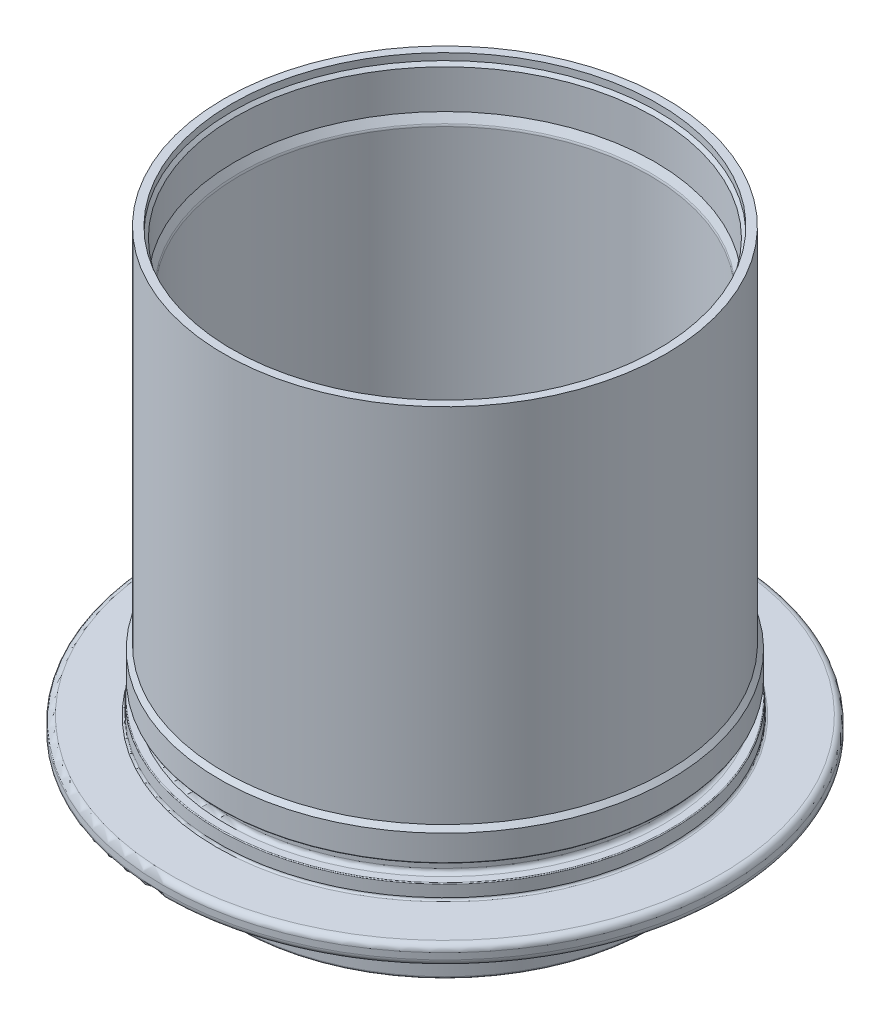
ISO-10303-21;
HEADER;
FILE_DESCRIPTION(('STEP AP214'),'2;1');
FILE_NAME('part.step','',(''),(''),'','','');
FILE_SCHEMA(('AUTOMOTIVE_DESIGN { 1 0 10303 214 1 1 1 1 }'));
ENDSEC;
DATA;
#1=APPLICATION_CONTEXT('core data for automotive mechanical design processes');
#2=APPLICATION_PROTOCOL_DEFINITION('international standard','automotive_design',2000,#1);
#3=PRODUCT_CONTEXT('',#1,'mechanical');
#4=PRODUCT('Part','Part','',(#3));
#5=PRODUCT_RELATED_PRODUCT_CATEGORY('part','',(#4));
#6=PRODUCT_DEFINITION_FORMATION('','',#4);
#7=PRODUCT_DEFINITION_CONTEXT('part definition',#1,'design');
#8=PRODUCT_DEFINITION('design','',#6,#7);
#9=PRODUCT_DEFINITION_SHAPE('','',#8);
#10=(LENGTH_UNIT() NAMED_UNIT(*) SI_UNIT(.MILLI.,.METRE.));
#11=(NAMED_UNIT(*) PLANE_ANGLE_UNIT() SI_UNIT($,.RADIAN.));
#12=(NAMED_UNIT(*) SI_UNIT($,.STERADIAN.) SOLID_ANGLE_UNIT());
#13=UNCERTAINTY_MEASURE_WITH_UNIT(LENGTH_MEASURE(1.E-05),#10,'distance_accuracy_value','');
#14=(GEOMETRIC_REPRESENTATION_CONTEXT(3) GLOBAL_UNCERTAINTY_ASSIGNED_CONTEXT((#13)) GLOBAL_UNIT_ASSIGNED_CONTEXT((#10,
#11,#12)) REPRESENTATION_CONTEXT('',''));
#15=CARTESIAN_POINT('',(0.,0.,0.));
#16=DIRECTION('',(0.,0.,1.));
#17=DIRECTION('',(1.,0.,0.));
#18=AXIS2_PLACEMENT_3D('',#15,#16,#17);
#19=CARTESIAN_POINT('',(-71.1716849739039,148.965678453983,0.));
#20=DIRECTION('',(0.,1.,0.));
#21=DIRECTION('',(-1.,0.,0.));
#22=AXIS2_PLACEMENT_3D('',#19,#20,#21);
#23=CONICAL_SURFACE('',#22,50.25,0.785398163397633);
#24=CARTESIAN_POINT('',(-71.1716849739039,148.965678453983,0.));
#25=DIRECTION('',(0.,1.,0.));
#26=DIRECTION('',(-1.,0.,0.));
#27=AXIS2_PLACEMENT_3D('',#24,#25,#26);
#28=CIRCLE('',#27,50.25);
#29=CARTESIAN_POINT('',(-121.421684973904,148.965678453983,0.));
#30=VERTEX_POINT('',#29);
#31=EDGE_CURVE('E78',#30,#30,#28,.T.);
#32=ORIENTED_EDGE('',*,*,#31,.F.);
#33=EDGE_LOOP('',(#32));
#34=FACE_BOUND('',#33,.T.);
#35=CARTESIAN_POINT('',(-71.1716849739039,149.715678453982,0.));
#36=DIRECTION('',(0.,1.,0.));
#37=DIRECTION('',(-1.,0.,0.));
#38=AXIS2_PLACEMENT_3D('',#35,#36,#37);
#39=CIRCLE('',#38,51.);
#40=CARTESIAN_POINT('',(-122.171684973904,149.715678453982,0.));
#41=VERTEX_POINT('',#40);
#42=EDGE_CURVE('E53',#41,#41,#39,.T.);
#43=ORIENTED_EDGE('',*,*,#42,.T.);
#44=EDGE_LOOP('',(#43));
#45=FACE_BOUND('',#44,.T.);
#46=ADVANCED_FACE('F34',(#34,#45),#23,.F.);
#47=CARTESIAN_POINT('',(-71.1716849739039,54.6294667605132,0.));
#48=DIRECTION('',(0.,1.,0.));
#49=DIRECTION('',(-1.,0.,0.));
#50=AXIS2_PLACEMENT_3D('',#47,#48,#49);
#51=TOROIDAL_SURFACE('',#50,37.0850000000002,11.9999999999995);
#52=CARTESIAN_POINT('',(-71.1716849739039,54.6294667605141,0.));
#53=DIRECTION('',(0.,1.,0.));
#54=DIRECTION('',(-1.,0.,0.));
#55=AXIS2_PLACEMENT_3D('',#52,#53,#54);
#56=CIRCLE('',#55,49.085);
#57=CARTESIAN_POINT('',(-120.256684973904,54.629466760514,0.));
#58=VERTEX_POINT('',#57);
#59=EDGE_CURVE('E55',#58,#58,#56,.T.);
#60=ORIENTED_EDGE('',*,*,#59,.T.);
#61=EDGE_LOOP('',(#60));
#62=FACE_BOUND('',#61,.T.);
#63=CARTESIAN_POINT('',(-71.1716849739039,46.1441853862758,0.));
#64=DIRECTION('',(0.,1.,0.));
#65=DIRECTION('',(-1.,0.,0.));
#66=AXIS2_PLACEMENT_3D('',#63,#64,#65);
#67=CIRCLE('',#66,45.5702813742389);
#68=CARTESIAN_POINT('',(-116.741966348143,46.1441853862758,0.));
#69=VERTEX_POINT('',#68);
#70=EDGE_CURVE('E41',#69,#69,#67,.T.);
#71=ORIENTED_EDGE('',*,*,#70,.F.);
#72=EDGE_LOOP('',(#71));
#73=FACE_BOUND('',#72,.T.);
#74=ADVANCED_FACE('F36',(#62,#73),#51,.F.);
#75=CARTESIAN_POINT('',(-71.1716849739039,40.4667972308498,0.));
#76=DIRECTION('',(0.,1.,0.));
#77=DIRECTION('',(-1.,0.,0.));
#78=AXIS2_PLACEMENT_3D('',#75,#76,#77);
#79=CONICAL_SURFACE('',#78,39.8928932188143,0.785398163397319);
#80=ORIENTED_EDGE('',*,*,#70,.T.);
#81=EDGE_LOOP('',(#80));
#82=FACE_BOUND('',#81,.T.);
#83=CARTESIAN_POINT('',(-71.1716849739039,40.4667972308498,0.));
#84=DIRECTION('',(0.,1.,0.));
#85=DIRECTION('',(-1.,0.,0.));
#86=AXIS2_PLACEMENT_3D('',#83,#84,#85);
#87=CIRCLE('',#86,39.8928932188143);
#88=CARTESIAN_POINT('',(-111.064578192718,40.4667972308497,0.));
#89=VERTEX_POINT('',#88);
#90=EDGE_CURVE('E45',#89,#89,#87,.T.);
#91=ORIENTED_EDGE('',*,*,#90,.F.);
#92=EDGE_LOOP('',(#91));
#93=FACE_BOUND('',#92,.T.);
#94=ADVANCED_FACE('F196',(#82,#93),#79,.F.);
#95=CARTESIAN_POINT('',(-71.1716849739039,39.7596904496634,0.));
#96=DIRECTION('',(0.,1.,0.));
#97=DIRECTION('',(-1.,0.,0.));
#98=AXIS2_PLACEMENT_3D('',#95,#96,#97);
#99=TOROIDAL_SURFACE('',#98,40.6000000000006,1.00000000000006);
#100=ORIENTED_EDGE('',*,*,#90,.T.);
#101=EDGE_LOOP('',(#100));
#102=FACE_BOUND('',#101,.T.);
#103=CARTESIAN_POINT('',(-71.1716849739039,39.7596904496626,0.));
#104=DIRECTION('',(0.,1.,0.));
#105=DIRECTION('',(-1.,0.,0.));
#106=AXIS2_PLACEMENT_3D('',#103,#104,#105);
#107=CIRCLE('',#106,39.6000000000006);
#108=CARTESIAN_POINT('',(-110.771684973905,39.7596904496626,0.));
#109=VERTEX_POINT('',#108);
#110=EDGE_CURVE('E50',#109,#109,#107,.T.);
#111=ORIENTED_EDGE('',*,*,#110,.F.);
#112=EDGE_LOOP('',(#111));
#113=FACE_BOUND('',#112,.T.);
#114=ADVANCED_FACE('F194',(#102,#113),#99,.T.);
#115=CARTESIAN_POINT('',(-71.1716849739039,158.736724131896,0.));
#116=DIRECTION('',(0.,1.,0.));
#117=DIRECTION('',(-1.,0.,0.));
#118=AXIS2_PLACEMENT_3D('',#115,#116,#117);
#119=CYLINDRICAL_SURFACE('',#118,39.6000000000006);
#120=ORIENTED_EDGE('',*,*,#110,.T.);
#121=EDGE_LOOP('',(#120));
#122=FACE_BOUND('',#121,.T.);
#123=CARTESIAN_POINT('',(-71.1716849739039,39.2739577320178,0.));
#124=DIRECTION('',(0.,1.,0.));
#125=DIRECTION('',(-1.,0.,0.));
#126=AXIS2_PLACEMENT_3D('',#123,#124,#125);
#127=CIRCLE('',#126,39.6000000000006);
#128=CARTESIAN_POINT('',(-110.771684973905,39.2739577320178,0.));
#129=VERTEX_POINT('',#128);
#130=EDGE_CURVE('E186',#129,#129,#127,.T.);
#131=ORIENTED_EDGE('',*,*,#130,.F.);
#132=EDGE_LOOP('',(#131));
#133=FACE_BOUND('',#132,.T.);
#134=ADVANCED_FACE('F191',(#122,#133),#119,.F.);
#135=CARTESIAN_POINT('',(-71.1716849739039,39.2739577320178,0.));
#136=DIRECTION('',(0.,1.,0.));
#137=DIRECTION('',(-1.,0.,0.));
#138=AXIS2_PLACEMENT_3D('',#135,#136,#137);
#139=TOROIDAL_SURFACE('',#138,40.0000000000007,0.400000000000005);
#140=ORIENTED_EDGE('',*,*,#130,.T.);
#141=EDGE_LOOP('',(#140));
#142=FACE_BOUND('',#141,.T.);
#143=CARTESIAN_POINT('',(-71.1716849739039,38.8739577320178,0.));
#144=DIRECTION('',(0.,1.,0.));
#145=DIRECTION('',(-1.,0.,0.));
#146=AXIS2_PLACEMENT_3D('',#143,#144,#145);
#147=CIRCLE('',#146,40.0000000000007);
#148=CARTESIAN_POINT('',(-111.171684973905,38.8739577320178,0.));
#149=VERTEX_POINT('',#148);
#150=EDGE_CURVE('E183',#149,#149,#147,.T.);
#151=ORIENTED_EDGE('',*,*,#150,.F.);
#152=EDGE_LOOP('',(#151));
#153=FACE_BOUND('',#152,.T.);
#154=ADVANCED_FACE('F203',(#142,#153),#139,.T.);
#155=CARTESIAN_POINT('',(-113.496714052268,38.8739577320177,0.));
#156=DIRECTION('',(0.,-1.,0.));
#157=DIRECTION('',(1.,0.,0.));
#158=AXIS2_PLACEMENT_3D('',#155,#156,#157);
#159=PLANE('',#158);
#160=ORIENTED_EDGE('',*,*,#150,.T.);
#161=EDGE_LOOP('',(#160));
#162=FACE_BOUND('',#161,.T.);
#163=CARTESIAN_POINT('',(-71.1716849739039,38.8739577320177,0.));
#164=DIRECTION('',(0.,1.,0.));
#165=DIRECTION('',(-1.,0.,0.));
#166=AXIS2_PLACEMENT_3D('',#163,#164,#165);
#167=CIRCLE('',#166,42.3250290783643);
#168=CARTESIAN_POINT('',(-113.496714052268,38.8739577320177,0.));
#169=VERTEX_POINT('',#168);
#170=EDGE_CURVE('E180',#169,#169,#167,.T.);
#171=ORIENTED_EDGE('',*,*,#170,.F.);
#172=EDGE_LOOP('',(#171));
#173=FACE_BOUND('',#172,.T.);
#174=ADVANCED_FACE('F352',(#162,#173),#159,.T.);
#175=CARTESIAN_POINT('',(-71.1716849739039,37.3739577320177,0.));
#176=DIRECTION('',(0.,1.,0.));
#177=DIRECTION('',(-1.,0.,0.));
#178=AXIS2_PLACEMENT_3D('',#175,#176,#177);
#179=TOROIDAL_SURFACE('',#178,42.3250290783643,1.5);
#180=ORIENTED_EDGE('',*,*,#170,.T.);
#181=EDGE_LOOP('',(#180));
#182=FACE_BOUND('',#181,.T.);
#183=CARTESIAN_POINT('',(-71.1716849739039,37.3739577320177,0.));
#184=DIRECTION('',(0.,1.,0.));
#185=DIRECTION('',(-1.,0.,0.));
#186=AXIS2_PLACEMENT_3D('',#183,#184,#185);
#187=CIRCLE('',#186,43.8250290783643);
#188=CARTESIAN_POINT('',(-114.996714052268,37.3739577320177,0.));
#189=VERTEX_POINT('',#188);
#190=EDGE_CURVE('E177',#189,#189,#187,.T.);
#191=ORIENTED_EDGE('',*,*,#190,.F.);
#192=EDGE_LOOP('',(#191));
#193=FACE_BOUND('',#192,.T.);
#194=ADVANCED_FACE('F348',(#182,#193),#179,.F.);
#195=CARTESIAN_POINT('',(-71.1716849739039,158.736724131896,0.));
#196=DIRECTION('',(0.,1.,0.));
#197=DIRECTION('',(-1.,0.,0.));
#198=AXIS2_PLACEMENT_3D('',#195,#196,#197);
#199=CYLINDRICAL_SURFACE('',#198,43.8250290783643);
#200=ORIENTED_EDGE('',*,*,#190,.T.);
#201=EDGE_LOOP('',(#200));
#202=FACE_BOUND('',#201,.T.);
#203=CARTESIAN_POINT('',(-71.1716849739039,34.3739577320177,0.));
#204=DIRECTION('',(0.,1.,0.));
#205=DIRECTION('',(-1.,0.,0.));
#206=AXIS2_PLACEMENT_3D('',#203,#204,#205);
#207=CIRCLE('',#206,43.8250290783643);
#208=CARTESIAN_POINT('',(-114.996714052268,34.3739577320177,0.));
#209=VERTEX_POINT('',#208);
#210=EDGE_CURVE('E174',#209,#209,#207,.T.);
#211=ORIENTED_EDGE('',*,*,#210,.F.);
#212=EDGE_LOOP('',(#211));
#213=FACE_BOUND('',#212,.T.);
#214=ADVANCED_FACE('F344',(#202,#213),#199,.F.);
#215=CARTESIAN_POINT('',(-71.1716849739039,34.3739577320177,0.));
#216=DIRECTION('',(0.,1.,0.));
#217=DIRECTION('',(-1.,0.,0.));
#218=AXIS2_PLACEMENT_3D('',#215,#216,#217);
#219=TOROIDAL_SURFACE('',#218,42.3250290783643,1.5);
#220=ORIENTED_EDGE('',*,*,#210,.T.);
#221=EDGE_LOOP('',(#220));
#222=FACE_BOUND('',#221,.T.);
#223=CARTESIAN_POINT('',(-71.1716849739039,32.8739577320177,0.));
#224=DIRECTION('',(0.,1.,0.));
#225=DIRECTION('',(-1.,0.,0.));
#226=AXIS2_PLACEMENT_3D('',#223,#224,#225);
#227=CIRCLE('',#226,42.3250290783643);
#228=CARTESIAN_POINT('',(-113.496714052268,32.8739577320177,0.));
#229=VERTEX_POINT('',#228);
#230=EDGE_CURVE('E171',#229,#229,#227,.T.);
#231=ORIENTED_EDGE('',*,*,#230,.F.);
#232=EDGE_LOOP('',(#231));
#233=FACE_BOUND('',#232,.T.);
#234=ADVANCED_FACE('F340',(#222,#233),#219,.F.);
#235=CARTESIAN_POINT('',(-113.496714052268,32.8739577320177,0.));
#236=DIRECTION('',(0.,1.,0.));
#237=DIRECTION('',(-1.,0.,0.));
#238=AXIS2_PLACEMENT_3D('',#235,#236,#237);
#239=PLANE('',#238);
#240=ORIENTED_EDGE('',*,*,#230,.T.);
#241=EDGE_LOOP('',(#240));
#242=FACE_BOUND('',#241,.T.);
#243=CARTESIAN_POINT('',(-71.1716849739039,32.8739577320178,0.));
#244=DIRECTION('',(0.,1.,0.));
#245=DIRECTION('',(-1.,0.,0.));
#246=AXIS2_PLACEMENT_3D('',#243,#244,#245);
#247=CIRCLE('',#246,39.3500000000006);
#248=CARTESIAN_POINT('',(-110.521684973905,32.8739577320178,0.));
#249=VERTEX_POINT('',#248);
#250=EDGE_CURVE('E168',#249,#249,#247,.T.);
#251=ORIENTED_EDGE('',*,*,#250,.F.);
#252=EDGE_LOOP('',(#251));
#253=FACE_BOUND('',#252,.T.);
#254=ADVANCED_FACE('F336',(#242,#253),#239,.T.);
#255=CARTESIAN_POINT('',(-71.1716849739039,32.4739577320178,0.));
#256=DIRECTION('',(0.,1.,0.));
#257=DIRECTION('',(-1.,0.,0.));
#258=AXIS2_PLACEMENT_3D('',#255,#256,#257);
#259=TOROIDAL_SURFACE('',#258,39.3500000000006,0.399999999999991);
#260=ORIENTED_EDGE('',*,*,#250,.T.);
#261=EDGE_LOOP('',(#260));
#262=FACE_BOUND('',#261,.T.);
#263=CARTESIAN_POINT('',(-71.1716849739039,32.4739577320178,0.));
#264=DIRECTION('',(0.,1.,0.));
#265=DIRECTION('',(-1.,0.,0.));
#266=AXIS2_PLACEMENT_3D('',#263,#264,#265);
#267=CIRCLE('',#266,38.9500000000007);
#268=CARTESIAN_POINT('',(-110.121684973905,32.4739577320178,0.));
#269=VERTEX_POINT('',#268);
#270=EDGE_CURVE('E165',#269,#269,#267,.T.);
#271=ORIENTED_EDGE('',*,*,#270,.F.);
#272=EDGE_LOOP('',(#271));
#273=FACE_BOUND('',#272,.T.);
#274=ADVANCED_FACE('F332',(#262,#273),#259,.T.);
#275=CARTESIAN_POINT('',(-71.1716849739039,158.736724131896,0.));
#276=DIRECTION('',(0.,1.,0.));
#277=DIRECTION('',(-1.,0.,0.));
#278=AXIS2_PLACEMENT_3D('',#275,#276,#277);
#279=CYLINDRICAL_SURFACE('',#278,38.9500000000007);
#280=ORIENTED_EDGE('',*,*,#270,.T.);
#281=EDGE_LOOP('',(#280));
#282=FACE_BOUND('',#281,.T.);
#283=CARTESIAN_POINT('',(-71.1716849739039,31.6419486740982,0.));
#284=DIRECTION('',(0.,1.,0.));
#285=DIRECTION('',(-1.,0.,0.));
#286=AXIS2_PLACEMENT_3D('',#283,#284,#285);
#287=CIRCLE('',#286,38.9500000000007);
#288=CARTESIAN_POINT('',(-110.121684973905,31.6419486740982,0.));
#289=VERTEX_POINT('',#288);
#290=EDGE_CURVE('E162',#289,#289,#287,.T.);
#291=ORIENTED_EDGE('',*,*,#290,.F.);
#292=EDGE_LOOP('',(#291));
#293=FACE_BOUND('',#292,.T.);
#294=ADVANCED_FACE('F328',(#282,#293),#279,.F.);
#295=CARTESIAN_POINT('',(-71.1716849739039,31.6419486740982,0.));
#296=DIRECTION('',(0.,1.,0.));
#297=DIRECTION('',(-1.,0.,0.));
#298=AXIS2_PLACEMENT_3D('',#295,#296,#297);
#299=TOROIDAL_SURFACE('',#298,39.9500000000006,1.00000000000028);
#300=ORIENTED_EDGE('',*,*,#290,.T.);
#301=EDGE_LOOP('',(#300));
#302=FACE_BOUND('',#301,.T.);
#303=CARTESIAN_POINT('',(-71.1716849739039,31.1419486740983,0.));
#304=DIRECTION('',(0.,1.,0.));
#305=DIRECTION('',(-1.,0.,0.));
#306=AXIS2_PLACEMENT_3D('',#303,#304,#305);
#307=CIRCLE('',#306,39.0839745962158);
#308=CARTESIAN_POINT('',(-110.25565957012,31.1419486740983,0.));
#309=VERTEX_POINT('',#308);
#310=EDGE_CURVE('E159',#309,#309,#307,.T.);
#311=ORIENTED_EDGE('',*,*,#310,.F.);
#312=EDGE_LOOP('',(#311));
#313=FACE_BOUND('',#312,.T.);
#314=ADVANCED_FACE('F324',(#302,#313),#299,.T.);
#315=CARTESIAN_POINT('',(-71.1716849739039,30.3739577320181,0.));
#316=DIRECTION('',(0.,-1.,0.));
#317=DIRECTION('',(1.,0.,0.));
#318=AXIS2_PLACEMENT_3D('',#315,#316,#317);
#319=CONICAL_SURFACE('',#318,39.5273743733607,0.523598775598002);
#320=ORIENTED_EDGE('',*,*,#310,.T.);
#321=EDGE_LOOP('',(#320));
#322=FACE_BOUND('',#321,.T.);
#323=CARTESIAN_POINT('',(-71.1716849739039,30.3739577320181,0.));
#324=DIRECTION('',(0.,1.,0.));
#325=DIRECTION('',(-1.,0.,0.));
#326=AXIS2_PLACEMENT_3D('',#323,#324,#325);
#327=CIRCLE('',#326,39.5273743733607);
#328=CARTESIAN_POINT('',(-110.699059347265,30.3739577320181,0.));
#329=VERTEX_POINT('',#328);
#330=EDGE_CURVE('E156',#329,#329,#327,.T.);
#331=ORIENTED_EDGE('',*,*,#330,.F.);
#332=EDGE_LOOP('',(#331));
#333=FACE_BOUND('',#332,.T.);
#334=ADVANCED_FACE('F320',(#322,#333),#319,.F.);
#335=CARTESIAN_POINT('',(-110.699059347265,30.3739577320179,0.));
#336=DIRECTION('',(0.,-1.,0.));
#337=DIRECTION('',(1.,0.,0.));
#338=AXIS2_PLACEMENT_3D('',#335,#336,#337);
#339=PLANE('',#338);
#340=ORIENTED_EDGE('',*,*,#330,.T.);
#341=EDGE_LOOP('',(#340));
#342=FACE_BOUND('',#341,.T.);
#343=CARTESIAN_POINT('',(-71.1716849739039,30.3739577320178,0.));
#344=DIRECTION('',(0.,1.,0.));
#345=DIRECTION('',(-1.,0.,0.));
#346=AXIS2_PLACEMENT_3D('',#343,#344,#345);
#347=CIRCLE('',#346,49.3000000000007);
#348=CARTESIAN_POINT('',(-120.471684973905,30.3739577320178,0.));
#349=VERTEX_POINT('',#348);
#350=EDGE_CURVE('E153',#349,#349,#347,.T.);
#351=ORIENTED_EDGE('',*,*,#350,.F.);
#352=EDGE_LOOP('',(#351));
#353=FACE_BOUND('',#352,.T.);
#354=ADVANCED_FACE('F316',(#342,#353),#339,.T.);
#355=CARTESIAN_POINT('',(-71.1716849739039,30.8739577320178,0.));
#356=DIRECTION('',(0.,1.,0.));
#357=DIRECTION('',(-1.,0.,0.));
#358=AXIS2_PLACEMENT_3D('',#355,#356,#357);
#359=TOROIDAL_SURFACE('',#358,49.3000000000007,0.500000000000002);
#360=ORIENTED_EDGE('',*,*,#350,.T.);
#361=EDGE_LOOP('',(#360));
#362=FACE_BOUND('',#361,.T.);
#363=CARTESIAN_POINT('',(-71.1716849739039,30.8739577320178,0.));
#364=DIRECTION('',(0.,1.,0.));
#365=DIRECTION('',(-1.,0.,0.));
#366=AXIS2_PLACEMENT_3D('',#363,#364,#365);
#367=CIRCLE('',#366,49.8000000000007);
#368=CARTESIAN_POINT('',(-120.971684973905,30.8739577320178,0.));
#369=VERTEX_POINT('',#368);
#370=EDGE_CURVE('E150',#369,#369,#367,.T.);
#371=ORIENTED_EDGE('',*,*,#370,.F.);
#372=EDGE_LOOP('',(#371));
#373=FACE_BOUND('',#372,.T.);
#374=ADVANCED_FACE('F312',(#362,#373),#359,.T.);
#375=CARTESIAN_POINT('',(-71.1716849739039,158.736724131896,0.));
#376=DIRECTION('',(0.,1.,0.));
#377=DIRECTION('',(-1.,0.,0.));
#378=AXIS2_PLACEMENT_3D('',#375,#376,#377);
#379=CYLINDRICAL_SURFACE('',#378,49.8000000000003);
#380=ORIENTED_EDGE('',*,*,#370,.T.);
#381=EDGE_LOOP('',(#380));
#382=FACE_BOUND('',#381,.T.);
#383=CARTESIAN_POINT('',(-71.1716849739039,34.5858430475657,0.));
#384=DIRECTION('',(0.,1.,0.));
#385=DIRECTION('',(-1.,0.,0.));
#386=AXIS2_PLACEMENT_3D('',#383,#384,#385);
#387=CIRCLE('',#386,49.8);
#388=CARTESIAN_POINT('',(-120.971684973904,34.5858430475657,0.));
#389=VERTEX_POINT('',#388);
#390=EDGE_CURVE('E147',#389,#389,#387,.T.);
#391=ORIENTED_EDGE('',*,*,#390,.F.);
#392=EDGE_LOOP('',(#391));
#393=FACE_BOUND('',#392,.T.);
#394=ADVANCED_FACE('F308',(#382,#393),#379,.T.);
#395=CARTESIAN_POINT('',(-71.1716849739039,34.5858430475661,0.));
#396=DIRECTION('',(0.,1.,0.));
#397=DIRECTION('',(-1.,0.,0.));
#398=AXIS2_PLACEMENT_3D('',#395,#396,#397);
#399=TOROIDAL_SURFACE('',#398,48.3000000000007,1.49999999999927);
#400=ORIENTED_EDGE('',*,*,#390,.T.);
#401=EDGE_LOOP('',(#400));
#402=FACE_BOUND('',#401,.T.);
#403=CARTESIAN_POINT('',(-71.1716849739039,35.3358430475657,0.));
#404=DIRECTION('',(0.,1.,0.));
#405=DIRECTION('',(-1.,0.,0.));
#406=AXIS2_PLACEMENT_3D('',#403,#404,#405);
#407=CIRCLE('',#406,49.5990381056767);
#408=CARTESIAN_POINT('',(-120.770723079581,35.3358430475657,0.));
#409=VERTEX_POINT('',#408);
#410=EDGE_CURVE('E144',#409,#409,#407,.T.);
#411=ORIENTED_EDGE('',*,*,#410,.F.);
#412=EDGE_LOOP('',(#411));
#413=FACE_BOUND('',#412,.T.);
#414=ADVANCED_FACE('F304',(#402,#413),#399,.T.);
#415=CARTESIAN_POINT('',(-71.1716849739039,37.93058715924,0.));
#416=DIRECTION('',(0.,-1.,0.));
#417=DIRECTION('',(1.,0.,0.));
#418=AXIS2_PLACEMENT_3D('',#415,#416,#417);
#419=CONICAL_SURFACE('',#418,48.1009618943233,0.523598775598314);
#420=ORIENTED_EDGE('',*,*,#410,.T.);
#421=EDGE_LOOP('',(#420));
#422=FACE_BOUND('',#421,.T.);
#423=CARTESIAN_POINT('',(-71.1716849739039,37.93058715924,0.));
#424=DIRECTION('',(0.,1.,0.));
#425=DIRECTION('',(-1.,0.,0.));
#426=AXIS2_PLACEMENT_3D('',#423,#424,#425);
#427=CIRCLE('',#426,48.1009618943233);
#428=CARTESIAN_POINT('',(-119.272646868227,37.93058715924,0.));
#429=VERTEX_POINT('',#428);
#430=EDGE_CURVE('E141',#429,#429,#427,.T.);
#431=ORIENTED_EDGE('',*,*,#430,.F.);
#432=EDGE_LOOP('',(#431));
#433=FACE_BOUND('',#432,.T.);
#434=ADVANCED_FACE('F300',(#422,#433),#419,.T.);
#435=CARTESIAN_POINT('',(-71.1716849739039,38.6805871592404,0.));
#436=DIRECTION('',(0.,1.,0.));
#437=DIRECTION('',(-1.,0.,0.));
#438=AXIS2_PLACEMENT_3D('',#435,#436,#437);
#439=TOROIDAL_SURFACE('',#438,49.4000000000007,1.50000000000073);
#440=ORIENTED_EDGE('',*,*,#430,.T.);
#441=EDGE_LOOP('',(#440));
#442=FACE_BOUND('',#441,.T.);
#443=CARTESIAN_POINT('',(-71.1716849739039,38.68058715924,0.));
#444=DIRECTION('',(0.,1.,0.));
#445=DIRECTION('',(-1.,0.,0.));
#446=AXIS2_PLACEMENT_3D('',#443,#444,#445);
#447=CIRCLE('',#446,47.8999999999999);
#448=CARTESIAN_POINT('',(-119.071684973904,38.6805871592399,0.));
#449=VERTEX_POINT('',#448);
#450=EDGE_CURVE('E138',#449,#449,#447,.T.);
#451=ORIENTED_EDGE('',*,*,#450,.F.);
#452=EDGE_LOOP('',(#451));
#453=FACE_BOUND('',#452,.T.);
#454=ADVANCED_FACE('F296',(#442,#453),#439,.F.);
#455=CARTESIAN_POINT('',(-71.1716849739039,158.736724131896,0.));
#456=DIRECTION('',(0.,1.,0.));
#457=DIRECTION('',(-1.,0.,0.));
#458=AXIS2_PLACEMENT_3D('',#455,#456,#457);
#459=CYLINDRICAL_SURFACE('',#458,47.9);
#460=ORIENTED_EDGE('',*,*,#450,.T.);
#461=EDGE_LOOP('',(#460));
#462=FACE_BOUND('',#461,.T.);
#463=CARTESIAN_POINT('',(-71.1716849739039,40.8767395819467,0.));
#464=DIRECTION('',(0.,1.,0.));
#465=DIRECTION('',(-1.,0.,0.));
#466=AXIS2_PLACEMENT_3D('',#463,#464,#465);
#467=CIRCLE('',#466,47.9000000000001);
#468=CARTESIAN_POINT('',(-119.071684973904,40.8767395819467,0.));
#469=VERTEX_POINT('',#468);
#470=EDGE_CURVE('E135',#469,#469,#467,.T.);
#471=ORIENTED_EDGE('',*,*,#470,.F.);
#472=EDGE_LOOP('',(#471));
#473=FACE_BOUND('',#472,.T.);
#474=ADVANCED_FACE('F292',(#462,#473),#459,.T.);
#475=CARTESIAN_POINT('',(-71.1716849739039,40.876739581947,0.));
#476=DIRECTION('',(0.,1.,0.));
#477=DIRECTION('',(-1.,0.,0.));
#478=AXIS2_PLACEMENT_3D('',#475,#476,#477);
#479=TOROIDAL_SURFACE('',#478,49.4000000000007,1.50000000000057);
#480=ORIENTED_EDGE('',*,*,#470,.T.);
#481=EDGE_LOOP('',(#480));
#482=FACE_BOUND('',#481,.T.);
#483=CARTESIAN_POINT('',(-71.1716849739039,41.626739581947,0.));
#484=DIRECTION('',(0.,1.,0.));
#485=DIRECTION('',(-1.,0.,0.));
#486=AXIS2_PLACEMENT_3D('',#483,#484,#485);
#487=CIRCLE('',#486,48.1009618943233);
#488=CARTESIAN_POINT('',(-119.272646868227,41.626739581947,0.));
#489=VERTEX_POINT('',#488);
#490=EDGE_CURVE('E132',#489,#489,#487,.T.);
#491=ORIENTED_EDGE('',*,*,#490,.F.);
#492=EDGE_LOOP('',(#491));
#493=FACE_BOUND('',#492,.T.);
#494=ADVANCED_FACE('F288',(#482,#493),#479,.F.);
#495=CARTESIAN_POINT('',(-71.1716849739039,44.6239577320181,0.));
#496=DIRECTION('',(0.,1.,0.));
#497=DIRECTION('',(-1.,0.,0.));
#498=AXIS2_PLACEMENT_3D('',#495,#496,#497);
#499=CONICAL_SURFACE('',#498,49.8314066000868,0.52359877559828);
#500=ORIENTED_EDGE('',*,*,#490,.T.);
#501=EDGE_LOOP('',(#500));
#502=FACE_BOUND('',#501,.T.);
#503=CARTESIAN_POINT('',(-71.1716849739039,44.6239577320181,0.));
#504=DIRECTION('',(0.,1.,0.));
#505=DIRECTION('',(-1.,0.,0.));
#506=AXIS2_PLACEMENT_3D('',#503,#504,#505);
#507=CIRCLE('',#506,49.8314066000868);
#508=CARTESIAN_POINT('',(-121.003091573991,44.6239577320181,0.));
#509=VERTEX_POINT('',#508);
#510=EDGE_CURVE('E129',#509,#509,#507,.T.);
#511=ORIENTED_EDGE('',*,*,#510,.F.);
#512=EDGE_LOOP('',(#511));
#513=FACE_BOUND('',#512,.T.);
#514=ADVANCED_FACE('F284',(#502,#513),#499,.T.);
#515=CARTESIAN_POINT('',(-71.1716849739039,43.8739577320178,0.));
#516=DIRECTION('',(0.,1.,0.));
#517=DIRECTION('',(-1.,0.,0.));
#518=AXIS2_PLACEMENT_3D('',#515,#516,#517);
#519=TOROIDAL_SURFACE('',#518,51.130444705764,1.50000000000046);
#520=ORIENTED_EDGE('',*,*,#510,.T.);
#521=EDGE_LOOP('',(#520));
#522=FACE_BOUND('',#521,.T.);
#523=CARTESIAN_POINT('',(-71.1716849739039,45.3739577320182,0.));
#524=DIRECTION('',(0.,1.,0.));
#525=DIRECTION('',(-1.,0.,0.));
#526=AXIS2_PLACEMENT_3D('',#523,#524,#525);
#527=CIRCLE('',#526,51.1304447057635);
#528=CARTESIAN_POINT('',(-122.302129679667,45.3739577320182,0.));
#529=VERTEX_POINT('',#528);
#530=EDGE_CURVE('E126',#529,#529,#527,.T.);
#531=ORIENTED_EDGE('',*,*,#530,.F.);
#532=EDGE_LOOP('',(#531));
#533=FACE_BOUND('',#532,.T.);
#534=ADVANCED_FACE('F280',(#522,#533),#519,.F.);
#535=CARTESIAN_POINT('',(-137.171684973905,45.373957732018,0.));
#536=DIRECTION('',(0.,-1.,0.));
#537=DIRECTION('',(1.,0.,0.));
#538=AXIS2_PLACEMENT_3D('',#535,#536,#537);
#539=PLANE('',#538);
#540=ORIENTED_EDGE('',*,*,#530,.T.);
#541=EDGE_LOOP('',(#540));
#542=FACE_BOUND('',#541,.T.);
#543=CARTESIAN_POINT('',(-71.1716849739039,45.3739577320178,0.));
#544=DIRECTION('',(0.,1.,0.));
#545=DIRECTION('',(-1.,0.,0.));
#546=AXIS2_PLACEMENT_3D('',#543,#544,#545);
#547=CIRCLE('',#546,66.0000000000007);
#548=CARTESIAN_POINT('',(-137.171684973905,45.3739577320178,0.));
#549=VERTEX_POINT('',#548);
#550=EDGE_CURVE('E123',#549,#549,#547,.T.);
#551=ORIENTED_EDGE('',*,*,#550,.F.);
#552=EDGE_LOOP('',(#551));
#553=FACE_BOUND('',#552,.T.);
#554=ADVANCED_FACE('F276',(#542,#553),#539,.T.);
#555=CARTESIAN_POINT('',(-71.1716849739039,46.8739577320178,0.));
#556=DIRECTION('',(0.,1.,0.));
#557=DIRECTION('',(-1.,0.,0.));
#558=AXIS2_PLACEMENT_3D('',#555,#556,#557);
#559=TOROIDAL_SURFACE('',#558,66.0000000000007,1.5);
#560=ORIENTED_EDGE('',*,*,#550,.T.);
#561=EDGE_LOOP('',(#560));
#562=FACE_BOUND('',#561,.T.);
#563=CARTESIAN_POINT('',(-71.1716849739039,46.8739577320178,0.));
#564=DIRECTION('',(0.,1.,0.));
#565=DIRECTION('',(-1.,0.,0.));
#566=AXIS2_PLACEMENT_3D('',#563,#564,#565);
#567=CIRCLE('',#566,67.5000000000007);
#568=CARTESIAN_POINT('',(-138.671684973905,46.8739577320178,0.));
#569=VERTEX_POINT('',#568);
#570=EDGE_CURVE('E120',#569,#569,#567,.T.);
#571=ORIENTED_EDGE('',*,*,#570,.F.);
#572=EDGE_LOOP('',(#571));
#573=FACE_BOUND('',#572,.T.);
#574=ADVANCED_FACE('F272',(#562,#573),#559,.T.);
#575=CARTESIAN_POINT('',(-71.1716849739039,158.736724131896,0.));
#576=DIRECTION('',(0.,1.,0.));
#577=DIRECTION('',(-1.,0.,0.));
#578=AXIS2_PLACEMENT_3D('',#575,#576,#577);
#579=CYLINDRICAL_SURFACE('',#578,67.5000000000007);
#580=ORIENTED_EDGE('',*,*,#570,.T.);
#581=EDGE_LOOP('',(#580));
#582=FACE_BOUND('',#581,.T.);
#583=CARTESIAN_POINT('',(-71.1716849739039,48.3739577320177,0.));
#584=DIRECTION('',(0.,1.,0.));
#585=DIRECTION('',(-1.,0.,0.));
#586=AXIS2_PLACEMENT_3D('',#583,#584,#585);
#587=CIRCLE('',#586,67.5000000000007);
#588=CARTESIAN_POINT('',(-138.671684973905,48.3739577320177,0.));
#589=VERTEX_POINT('',#588);
#590=EDGE_CURVE('E117',#589,#589,#587,.T.);
#591=ORIENTED_EDGE('',*,*,#590,.F.);
#592=EDGE_LOOP('',(#591));
#593=FACE_BOUND('',#592,.T.);
#594=ADVANCED_FACE('F268',(#582,#593),#579,.T.);
#595=CARTESIAN_POINT('',(-71.1716849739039,48.3739577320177,0.));
#596=DIRECTION('',(0.,1.,0.));
#597=DIRECTION('',(-1.,0.,0.));
#598=AXIS2_PLACEMENT_3D('',#595,#596,#597);
#599=TOROIDAL_SURFACE('',#598,66.0000000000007,1.5);
#600=ORIENTED_EDGE('',*,*,#590,.T.);
#601=EDGE_LOOP('',(#600));
#602=FACE_BOUND('',#601,.T.);
#603=CARTESIAN_POINT('',(-71.1716849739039,49.8739577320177,0.));
#604=DIRECTION('',(0.,1.,0.));
#605=DIRECTION('',(-1.,0.,0.));
#606=AXIS2_PLACEMENT_3D('',#603,#604,#605);
#607=CIRCLE('',#606,66.0000000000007);
#608=CARTESIAN_POINT('',(-137.171684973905,49.8739577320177,0.));
#609=VERTEX_POINT('',#608);
#610=EDGE_CURVE('E114',#609,#609,#607,.T.);
#611=ORIENTED_EDGE('',*,*,#610,.F.);
#612=EDGE_LOOP('',(#611));
#613=FACE_BOUND('',#612,.T.);
#614=ADVANCED_FACE('F264',(#602,#613),#599,.T.);
#615=CARTESIAN_POINT('',(-137.171684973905,49.8739577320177,0.));
#616=DIRECTION('',(0.,1.,0.));
#617=DIRECTION('',(-1.,0.,0.));
#618=AXIS2_PLACEMENT_3D('',#615,#616,#617);
#619=PLANE('',#618);
#620=ORIENTED_EDGE('',*,*,#610,.T.);
#621=EDGE_LOOP('',(#620));
#622=FACE_BOUND('',#621,.T.);
#623=CARTESIAN_POINT('',(-71.1716849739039,49.8739577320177,0.));
#624=DIRECTION('',(0.,1.,0.));
#625=DIRECTION('',(-1.,0.,0.));
#626=AXIS2_PLACEMENT_3D('',#623,#624,#625);
#627=CIRCLE('',#626,54.7000000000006);
#628=CARTESIAN_POINT('',(-125.871684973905,49.8739577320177,0.));
#629=VERTEX_POINT('',#628);
#630=EDGE_CURVE('E111',#629,#629,#627,.T.);
#631=ORIENTED_EDGE('',*,*,#630,.F.);
#632=EDGE_LOOP('',(#631));
#633=FACE_BOUND('',#632,.T.);
#634=ADVANCED_FACE('F260',(#622,#633),#619,.T.);
#635=CARTESIAN_POINT('',(-71.1716849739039,50.3739577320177,0.));
#636=DIRECTION('',(0.,1.,0.));
#637=DIRECTION('',(-1.,0.,0.));
#638=AXIS2_PLACEMENT_3D('',#635,#636,#637);
#639=TOROIDAL_SURFACE('',#638,54.7000000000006,0.5);
#640=ORIENTED_EDGE('',*,*,#630,.T.);
#641=EDGE_LOOP('',(#640));
#642=FACE_BOUND('',#641,.T.);
#643=CARTESIAN_POINT('',(-71.1716849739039,50.3739577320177,0.));
#644=DIRECTION('',(0.,1.,0.));
#645=DIRECTION('',(-1.,0.,0.));
#646=AXIS2_PLACEMENT_3D('',#643,#644,#645);
#647=CIRCLE('',#646,54.2000000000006);
#648=CARTESIAN_POINT('',(-125.371684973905,50.3739577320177,0.));
#649=VERTEX_POINT('',#648);
#650=EDGE_CURVE('E108',#649,#649,#647,.T.);
#651=ORIENTED_EDGE('',*,*,#650,.F.);
#652=EDGE_LOOP('',(#651));
#653=FACE_BOUND('',#652,.T.);
#654=ADVANCED_FACE('F256',(#642,#653),#639,.F.);
#655=CARTESIAN_POINT('',(-71.1716849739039,158.736724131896,0.));
#656=DIRECTION('',(0.,1.,0.));
#657=DIRECTION('',(-1.,0.,0.));
#658=AXIS2_PLACEMENT_3D('',#655,#656,#657);
#659=CYLINDRICAL_SURFACE('',#658,54.2000000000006);
#660=ORIENTED_EDGE('',*,*,#650,.T.);
#661=EDGE_LOOP('',(#660));
#662=FACE_BOUND('',#661,.T.);
#663=CARTESIAN_POINT('',(-71.1716849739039,53.1739577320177,0.));
#664=DIRECTION('',(0.,1.,0.));
#665=DIRECTION('',(-1.,0.,0.));
#666=AXIS2_PLACEMENT_3D('',#663,#664,#665);
#667=CIRCLE('',#666,54.2000000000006);
#668=CARTESIAN_POINT('',(-125.371684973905,53.1739577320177,0.));
#669=VERTEX_POINT('',#668);
#670=EDGE_CURVE('E105',#669,#669,#667,.T.);
#671=ORIENTED_EDGE('',*,*,#670,.F.);
#672=EDGE_LOOP('',(#671));
#673=FACE_BOUND('',#672,.T.);
#674=ADVANCED_FACE('F252',(#662,#673),#659,.T.);
#675=CARTESIAN_POINT('',(-71.1716849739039,53.1739577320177,0.));
#676=DIRECTION('',(0.,1.,0.));
#677=DIRECTION('',(-1.,0.,0.));
#678=AXIS2_PLACEMENT_3D('',#675,#676,#677);
#679=TOROIDAL_SURFACE('',#678,54.0000000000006,0.200000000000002);
#680=ORIENTED_EDGE('',*,*,#670,.T.);
#681=EDGE_LOOP('',(#680));
#682=FACE_BOUND('',#681,.T.);
#683=CARTESIAN_POINT('',(-71.1716849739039,53.3739577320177,0.));
#684=DIRECTION('',(0.,1.,0.));
#685=DIRECTION('',(-1.,0.,0.));
#686=AXIS2_PLACEMENT_3D('',#683,#684,#685);
#687=CIRCLE('',#686,54.0000000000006);
#688=CARTESIAN_POINT('',(-125.171684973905,53.3739577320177,0.));
#689=VERTEX_POINT('',#688);
#690=EDGE_CURVE('E102',#689,#689,#687,.T.);
#691=ORIENTED_EDGE('',*,*,#690,.F.);
#692=EDGE_LOOP('',(#691));
#693=FACE_BOUND('',#692,.T.);
#694=ADVANCED_FACE('F248',(#682,#693),#679,.T.);
#695=CARTESIAN_POINT('',(-125.171684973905,53.3739577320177,0.));
#696=DIRECTION('',(0.,1.,0.));
#697=DIRECTION('',(-1.,0.,0.));
#698=AXIS2_PLACEMENT_3D('',#695,#696,#697);
#699=PLANE('',#698);
#700=ORIENTED_EDGE('',*,*,#690,.T.);
#701=EDGE_LOOP('',(#700));
#702=FACE_BOUND('',#701,.T.);
#703=CARTESIAN_POINT('',(-71.1716849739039,53.3739577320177,0.));
#704=DIRECTION('',(0.,1.,0.));
#705=DIRECTION('',(-1.,0.,0.));
#706=AXIS2_PLACEMENT_3D('',#703,#704,#705);
#707=CIRCLE('',#706,52.2500000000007);
#708=CARTESIAN_POINT('',(-123.421684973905,53.3739577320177,0.));
#709=VERTEX_POINT('',#708);
#710=EDGE_CURVE('E99',#709,#709,#707,.T.);
#711=ORIENTED_EDGE('',*,*,#710,.F.);
#712=EDGE_LOOP('',(#711));
#713=FACE_BOUND('',#712,.T.);
#714=ADVANCED_FACE('F244',(#702,#713),#699,.T.);
#715=CARTESIAN_POINT('',(-71.1716849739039,54.3739577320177,0.));
#716=DIRECTION('',(0.,1.,0.));
#717=DIRECTION('',(-1.,0.,0.));
#718=AXIS2_PLACEMENT_3D('',#715,#716,#717);
#719=TOROIDAL_SURFACE('',#718,52.2500000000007,0.999999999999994);
#720=ORIENTED_EDGE('',*,*,#710,.T.);
#721=EDGE_LOOP('',(#720));
#722=FACE_BOUND('',#721,.T.);
#723=CARTESIAN_POINT('',(-71.1716849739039,54.3739577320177,0.));
#724=DIRECTION('',(0.,1.,0.));
#725=DIRECTION('',(-1.,0.,0.));
#726=AXIS2_PLACEMENT_3D('',#723,#724,#725);
#727=CIRCLE('',#726,51.2500000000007);
#728=CARTESIAN_POINT('',(-122.421684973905,54.3739577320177,0.));
#729=VERTEX_POINT('',#728);
#730=EDGE_CURVE('E96',#729,#729,#727,.T.);
#731=ORIENTED_EDGE('',*,*,#730,.F.);
#732=EDGE_LOOP('',(#731));
#733=FACE_BOUND('',#732,.T.);
#734=ADVANCED_FACE('F240',(#722,#733),#719,.F.);
#735=CARTESIAN_POINT('',(-71.1716849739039,158.736724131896,0.));
#736=DIRECTION('',(0.,1.,0.));
#737=DIRECTION('',(-1.,0.,0.));
#738=AXIS2_PLACEMENT_3D('',#735,#736,#737);
#739=CYLINDRICAL_SURFACE('',#738,51.2500000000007);
#740=ORIENTED_EDGE('',*,*,#730,.T.);
#741=EDGE_LOOP('',(#740));
#742=FACE_BOUND('',#741,.T.);
#743=CARTESIAN_POINT('',(-71.1716849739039,56.3239577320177,0.));
#744=DIRECTION('',(0.,1.,0.));
#745=DIRECTION('',(-1.,0.,0.));
#746=AXIS2_PLACEMENT_3D('',#743,#744,#745);
#747=CIRCLE('',#746,51.2500000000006);
#748=CARTESIAN_POINT('',(-122.421684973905,56.3239577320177,0.));
#749=VERTEX_POINT('',#748);
#750=EDGE_CURVE('E93',#749,#749,#747,.T.);
#751=ORIENTED_EDGE('',*,*,#750,.F.);
#752=EDGE_LOOP('',(#751));
#753=FACE_BOUND('',#752,.T.);
#754=ADVANCED_FACE('F236',(#742,#753),#739,.T.);
#755=CARTESIAN_POINT('',(-71.1716849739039,56.3239577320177,0.));
#756=DIRECTION('',(0.,1.,0.));
#757=DIRECTION('',(-1.,0.,0.));
#758=AXIS2_PLACEMENT_3D('',#755,#756,#757);
#759=TOROIDAL_SURFACE('',#758,52.2500000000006,1.);
#760=ORIENTED_EDGE('',*,*,#750,.T.);
#761=EDGE_LOOP('',(#760));
#762=FACE_BOUND('',#761,.T.);
#763=CARTESIAN_POINT('',(-71.1716849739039,57.3239577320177,0.));
#764=DIRECTION('',(0.,1.,0.));
#765=DIRECTION('',(-1.,0.,0.));
#766=AXIS2_PLACEMENT_3D('',#763,#764,#765);
#767=CIRCLE('',#766,52.2500000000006);
#768=CARTESIAN_POINT('',(-123.421684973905,57.3239577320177,0.));
#769=VERTEX_POINT('',#768);
#770=EDGE_CURVE('E90',#769,#769,#767,.T.);
#771=ORIENTED_EDGE('',*,*,#770,.F.);
#772=EDGE_LOOP('',(#771));
#773=FACE_BOUND('',#772,.T.);
#774=ADVANCED_FACE('F232',(#762,#773),#759,.F.);
#775=CARTESIAN_POINT('',(-123.421684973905,57.3239577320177,0.));
#776=DIRECTION('',(0.,-1.,0.));
#777=DIRECTION('',(1.,0.,0.));
#778=AXIS2_PLACEMENT_3D('',#775,#776,#777);
#779=PLANE('',#778);
#780=ORIENTED_EDGE('',*,*,#770,.T.);
#781=EDGE_LOOP('',(#780));
#782=FACE_BOUND('',#781,.T.);
#783=CARTESIAN_POINT('',(-71.1716849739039,57.3239577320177,0.));
#784=DIRECTION('',(0.,1.,0.));
#785=DIRECTION('',(-1.,0.,0.));
#786=AXIS2_PLACEMENT_3D('',#783,#784,#785);
#787=CIRCLE('',#786,53.8000000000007);
#788=CARTESIAN_POINT('',(-124.971684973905,57.3239577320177,0.));
#789=VERTEX_POINT('',#788);
#790=EDGE_CURVE('E87',#789,#789,#787,.T.);
#791=ORIENTED_EDGE('',*,*,#790,.F.);
#792=EDGE_LOOP('',(#791));
#793=FACE_BOUND('',#792,.T.);
#794=ADVANCED_FACE('F228',(#782,#793),#779,.T.);
#795=CARTESIAN_POINT('',(-71.1716849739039,57.5239577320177,0.));
#796=DIRECTION('',(0.,1.,0.));
#797=DIRECTION('',(-1.,0.,0.));
#798=AXIS2_PLACEMENT_3D('',#795,#796,#797);
#799=TOROIDAL_SURFACE('',#798,53.8000000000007,0.199999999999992);
#800=ORIENTED_EDGE('',*,*,#790,.T.);
#801=EDGE_LOOP('',(#800));
#802=FACE_BOUND('',#801,.T.);
#803=CARTESIAN_POINT('',(-71.1716849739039,57.5239577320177,0.));
#804=DIRECTION('',(0.,1.,0.));
#805=DIRECTION('',(-1.,0.,0.));
#806=AXIS2_PLACEMENT_3D('',#803,#804,#805);
#807=CIRCLE('',#806,54.0000000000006);
#808=CARTESIAN_POINT('',(-125.171684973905,57.5239577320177,0.));
#809=VERTEX_POINT('',#808);
#810=EDGE_CURVE('E84',#809,#809,#807,.T.);
#811=ORIENTED_EDGE('',*,*,#810,.F.);
#812=EDGE_LOOP('',(#811));
#813=FACE_BOUND('',#812,.T.);
#814=ADVANCED_FACE('F224',(#802,#813),#799,.T.);
#815=CARTESIAN_POINT('',(-71.1716849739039,158.736724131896,0.));
#816=DIRECTION('',(0.,1.,0.));
#817=DIRECTION('',(-1.,0.,0.));
#818=AXIS2_PLACEMENT_3D('',#815,#816,#817);
#819=CYLINDRICAL_SURFACE('',#818,54.0000000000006);
#820=ORIENTED_EDGE('',*,*,#810,.T.);
#821=EDGE_LOOP('',(#820));
#822=FACE_BOUND('',#821,.T.);
#823=CARTESIAN_POINT('',(-71.1716849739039,63.6239632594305,0.));
#824=DIRECTION('',(0.,1.,0.));
#825=DIRECTION('',(-1.,0.,0.));
#826=AXIS2_PLACEMENT_3D('',#823,#824,#825);
#827=CIRCLE('',#826,54.0000000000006);
#828=CARTESIAN_POINT('',(-125.171684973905,63.6239632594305,0.));
#829=VERTEX_POINT('',#828);
#830=EDGE_CURVE('E81',#829,#829,#827,.T.);
#831=ORIENTED_EDGE('',*,*,#830,.F.);
#832=EDGE_LOOP('',(#831));
#833=FACE_BOUND('',#832,.T.);
#834=ADVANCED_FACE('F220',(#822,#833),#819,.T.);
#835=CARTESIAN_POINT('',(-71.1716849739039,64.8739577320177,0.));
#836=DIRECTION('',(0.,-1.,0.));
#837=DIRECTION('',(1.,0.,0.));
#838=AXIS2_PLACEMENT_3D('',#835,#836,#837);
#839=CONICAL_SURFACE('',#838,52.7500000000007,0.785400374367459);
#840=CARTESIAN_POINT('',(-71.1716849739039,64.6739586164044,0.));
#841=DIRECTION('',(0.,-1.,0.));
#842=DIRECTION('',(1.,0.,0.));
#843=AXIS2_PLACEMENT_3D('',#840,#841,#842);
#844=CIRCLE('',#843,52.95);
#845=CARTESIAN_POINT('',(-124.121684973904,64.6739586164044,0.));
#846=VERTEX_POINT('',#845);
#847=EDGE_CURVE('E10',#846,#846,#844,.F.);
#848=ORIENTED_EDGE('',*,*,#847,.F.);
#849=EDGE_LOOP('',(#848));
#850=FACE_BOUND('',#849,.T.);
#851=ORIENTED_EDGE('',*,*,#830,.T.);
#852=EDGE_LOOP('',(#851));
#853=FACE_BOUND('',#852,.T.);
#854=ADVANCED_FACE('F217',(#850,#853),#839,.T.);
#855=CARTESIAN_POINT('',(-71.1716849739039,158.736724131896,0.));
#856=DIRECTION('',(0.,1.,0.));
#857=DIRECTION('',(-1.,0.,0.));
#858=AXIS2_PLACEMENT_3D('',#855,#856,#857);
#859=CYLINDRICAL_SURFACE('',#858,50.25);
#860=ORIENTED_EDGE('',*,*,#31,.T.);
#861=EDGE_LOOP('',(#860));
#862=FACE_BOUND('',#861,.T.);
#863=CARTESIAN_POINT('',(-71.1716849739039,139.672648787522,0.));
#864=DIRECTION('',(0.,1.,0.));
#865=DIRECTION('',(-1.,0.,0.));
#866=AXIS2_PLACEMENT_3D('',#863,#864,#865);
#867=CIRCLE('',#866,50.25);
#868=CARTESIAN_POINT('',(-121.421684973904,139.672648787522,0.));
#869=VERTEX_POINT('',#868);
#870=EDGE_CURVE('E75',#869,#869,#867,.T.);
#871=ORIENTED_EDGE('',*,*,#870,.F.);
#872=EDGE_LOOP('',(#871));
#873=FACE_BOUND('',#872,.T.);
#874=ADVANCED_FACE('F215',(#862,#873),#859,.F.);
#875=CARTESIAN_POINT('',(-71.1716849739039,137.886860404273,0.));
#876=DIRECTION('',(0.,1.,0.));
#877=DIRECTION('',(-1.,0.,0.));
#878=AXIS2_PLACEMENT_3D('',#875,#876,#877);
#879=CONICAL_SURFACE('',#878,49.2189745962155,0.523598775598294);
#880=ORIENTED_EDGE('',*,*,#870,.T.);
#881=EDGE_LOOP('',(#880));
#882=FACE_BOUND('',#881,.T.);
#883=CARTESIAN_POINT('',(-71.1716849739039,137.886860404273,0.));
#884=DIRECTION('',(0.,1.,0.));
#885=DIRECTION('',(-1.,0.,0.));
#886=AXIS2_PLACEMENT_3D('',#883,#884,#885);
#887=CIRCLE('',#886,49.2189745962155);
#888=CARTESIAN_POINT('',(-120.390659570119,137.886860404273,0.));
#889=VERTEX_POINT('',#888);
#890=EDGE_CURVE('E72',#889,#889,#887,.T.);
#891=ORIENTED_EDGE('',*,*,#890,.F.);
#892=EDGE_LOOP('',(#891));
#893=FACE_BOUND('',#892,.T.);
#894=ADVANCED_FACE('F583',(#882,#893),#879,.F.);
#895=CARTESIAN_POINT('',(-71.1716849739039,137.386860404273,0.));
#896=DIRECTION('',(0.,1.,0.));
#897=DIRECTION('',(-1.,0.,0.));
#898=AXIS2_PLACEMENT_3D('',#895,#896,#897);
#899=TOROIDAL_SURFACE('',#898,50.0850000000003,1.00000000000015);
#900=ORIENTED_EDGE('',*,*,#890,.T.);
#901=EDGE_LOOP('',(#900));
#902=FACE_BOUND('',#901,.T.);
#903=CARTESIAN_POINT('',(-71.1716849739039,137.386860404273,0.));
#904=DIRECTION('',(0.,1.,0.));
#905=DIRECTION('',(-1.,0.,0.));
#906=AXIS2_PLACEMENT_3D('',#903,#904,#905);
#907=CIRCLE('',#906,49.0850000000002);
#908=CARTESIAN_POINT('',(-120.256684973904,137.386860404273,0.));
#909=VERTEX_POINT('',#908);
#910=EDGE_CURVE('E60',#909,#909,#907,.T.);
#911=ORIENTED_EDGE('',*,*,#910,.F.);
#912=EDGE_LOOP('',(#911));
#913=FACE_BOUND('',#912,.T.);
#914=ADVANCED_FACE('F590',(#902,#913),#899,.T.);
#915=CARTESIAN_POINT('',(-71.1716849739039,158.736724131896,0.));
#916=DIRECTION('',(0.,1.,0.));
#917=DIRECTION('',(-1.,0.,0.));
#918=AXIS2_PLACEMENT_3D('',#915,#916,#917);
#919=CYLINDRICAL_SURFACE('',#918,49.0850000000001);
#920=ORIENTED_EDGE('',*,*,#910,.T.);
#921=EDGE_LOOP('',(#920));
#922=FACE_BOUND('',#921,.T.);
#923=ORIENTED_EDGE('',*,*,#59,.F.);
#924=EDGE_LOOP('',(#923));
#925=FACE_BOUND('',#924,.T.);
#926=ADVANCED_FACE('F598',(#922,#925),#919,.F.);
#927=CARTESIAN_POINT('',(-71.1716849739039,61.3739577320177,0.));
#928=DIRECTION('',(0.,1.,0.));
#929=DIRECTION('',(-1.,0.,0.));
#930=AXIS2_PLACEMENT_3D('',#927,#928,#929);
#931=CYLINDRICAL_SURFACE('',#930,52.95);
#932=CARTESIAN_POINT('',(-71.1716849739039,151.373957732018,0.));
#933=DIRECTION('',(0.,1.,0.));
#934=DIRECTION('',(-1.,0.,0.));
#935=AXIS2_PLACEMENT_3D('',#932,#933,#934);
#936=CIRCLE('',#935,52.95);
#937=CARTESIAN_POINT('',(-124.121684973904,151.373957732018,0.));
#938=VERTEX_POINT('',#937);
#939=EDGE_CURVE('E56',#938,#938,#936,.T.);
#940=CARTESIAN_POINT('',(-124.121684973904,64.6739586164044,0.));
#941=CARTESIAN_POINT('',(-124.121684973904,65.577083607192,0.));
#942=CARTESIAN_POINT('',(-124.121684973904,66.4802085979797,0.));
#943=CARTESIAN_POINT('',(-124.121684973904,68.2864585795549,0.));
#944=CARTESIAN_POINT('',(-124.121684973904,69.1895835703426,0.));
#945=CARTESIAN_POINT('',(-124.121684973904,70.9958335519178,0.));
#946=CARTESIAN_POINT('',(-124.121684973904,71.8989585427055,0.));
#947=CARTESIAN_POINT('',(-124.121684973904,73.7052085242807,0.));
#948=CARTESIAN_POINT('',(-124.121684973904,74.6083335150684,0.));
#949=CARTESIAN_POINT('',(-124.121684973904,76.4145834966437,0.));
#950=CARTESIAN_POINT('',(-124.121684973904,77.3177084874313,0.));
#951=CARTESIAN_POINT('',(-124.121684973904,79.1239584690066,0.));
#952=CARTESIAN_POINT('',(-124.121684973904,80.0270834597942,0.));
#953=CARTESIAN_POINT('',(-124.121684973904,81.8333334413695,0.));
#954=CARTESIAN_POINT('',(-124.121684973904,82.7364584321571,0.));
#955=CARTESIAN_POINT('',(-124.121684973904,84.5427084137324,0.));
#956=CARTESIAN_POINT('',(-124.121684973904,85.4458334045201,0.));
#957=CARTESIAN_POINT('',(-124.121684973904,87.2520833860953,0.));
#958=CARTESIAN_POINT('',(-124.121684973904,88.155208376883,0.));
#959=CARTESIAN_POINT('',(-124.121684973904,89.9614583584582,0.));
#960=CARTESIAN_POINT('',(-124.121684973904,90.8645833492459,0.));
#961=CARTESIAN_POINT('',(-124.121684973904,92.6708333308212,0.));
#962=CARTESIAN_POINT('',(-124.121684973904,93.5739583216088,0.));
#963=CARTESIAN_POINT('',(-124.121684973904,95.3802083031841,0.));
#964=CARTESIAN_POINT('',(-124.121684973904,96.2833332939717,0.));
#965=CARTESIAN_POINT('',(-124.121684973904,98.089583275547,0.));
#966=CARTESIAN_POINT('',(-124.121684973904,98.9927082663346,0.));
#967=CARTESIAN_POINT('',(-124.121684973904,100.79895824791,0.));
#968=CARTESIAN_POINT('',(-124.121684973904,101.702083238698,0.));
#969=CARTESIAN_POINT('',(-124.121684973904,103.508333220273,0.));
#970=CARTESIAN_POINT('',(-124.121684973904,104.41145821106,0.));
#971=CARTESIAN_POINT('',(-124.121684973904,106.217708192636,0.));
#972=CARTESIAN_POINT('',(-124.121684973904,107.120833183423,0.));
#973=CARTESIAN_POINT('',(-124.121684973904,108.927083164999,0.));
#974=CARTESIAN_POINT('',(-124.121684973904,109.830208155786,0.));
#975=CARTESIAN_POINT('',(-124.121684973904,111.636458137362,0.));
#976=CARTESIAN_POINT('',(-124.121684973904,112.539583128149,0.));
#977=CARTESIAN_POINT('',(-124.121684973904,114.345833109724,0.));
#978=CARTESIAN_POINT('',(-124.121684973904,115.248958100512,0.));
#979=CARTESIAN_POINT('',(-124.121684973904,117.055208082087,0.));
#980=CARTESIAN_POINT('',(-124.121684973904,117.958333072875,0.));
#981=CARTESIAN_POINT('',(-124.121684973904,119.76458305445,0.));
#982=CARTESIAN_POINT('',(-124.121684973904,120.667708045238,0.));
#983=CARTESIAN_POINT('',(-124.121684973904,122.473958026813,0.));
#984=CARTESIAN_POINT('',(-124.121684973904,123.377083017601,0.));
#985=CARTESIAN_POINT('',(-124.121684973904,125.183332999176,0.));
#986=CARTESIAN_POINT('',(-124.121684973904,126.086457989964,0.));
#987=CARTESIAN_POINT('',(-124.121684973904,127.892707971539,0.));
#988=CARTESIAN_POINT('',(-124.121684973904,128.795832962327,0.));
#989=CARTESIAN_POINT('',(-124.121684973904,130.602082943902,0.));
#990=CARTESIAN_POINT('',(-124.121684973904,131.50520793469,0.));
#991=CARTESIAN_POINT('',(-124.121684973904,133.311457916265,0.));
#992=CARTESIAN_POINT('',(-124.121684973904,134.214582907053,0.));
#993=CARTESIAN_POINT('',(-124.121684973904,136.020832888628,0.));
#994=CARTESIAN_POINT('',(-124.121684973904,136.923957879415,0.));
#995=CARTESIAN_POINT('',(-124.121684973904,138.730207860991,0.));
#996=CARTESIAN_POINT('',(-124.121684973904,139.633332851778,0.));
#997=CARTESIAN_POINT('',(-124.121684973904,141.439582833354,0.));
#998=CARTESIAN_POINT('',(-124.121684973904,142.342707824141,0.));
#999=CARTESIAN_POINT('',(-124.121684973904,144.148957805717,0.));
#1000=CARTESIAN_POINT('',(-124.121684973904,145.052082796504,0.));
#1001=CARTESIAN_POINT('',(-124.121684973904,146.858332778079,0.));
#1002=CARTESIAN_POINT('',(-124.121684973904,147.761457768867,0.));
#1003=CARTESIAN_POINT('',(-124.121684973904,149.567707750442,0.));
#1004=CARTESIAN_POINT('',(-124.121684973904,150.47083274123,0.));
#1005=CARTESIAN_POINT('',(-124.121684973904,151.373957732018,0.));
#1006=B_SPLINE_CURVE_WITH_KNOTS('',3,(#940,#941,#942,#943,#944,#945,#946,#947,#948,#949,#950,
#951,#952,#953,#954,#955,#956,#957,#958,#959,#960,#961,#962,#963,#964,#965,#966,#967,#968,#969,
#970,#971,#972,#973,#974,#975,#976,#977,#978,#979,#980,#981,#982,#983,#984,#985,#986,#987,#988,
#989,#990,#991,#992,#993,#994,#995,#996,#997,#998,#999,#1000,#1001,#1002,#1003,#1004,#1005),
.UNSPECIFIED.,.F.,.F.,(4,2,2,2,2,2,2,2,2,2,2,2,2,2,2,2,2,2,2,2,2,2,2,2,2,2,2,2,2,2,2,2,4),(0.,
2.70937497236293,5.41874994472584,8.12812491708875,10.8374998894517,13.5468748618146,
16.2562498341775,18.9656248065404,21.6749997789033,24.3843747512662,27.0937497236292,
29.8031246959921,32.512499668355,35.2218746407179,37.9312496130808,40.6406245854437,
43.3499995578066,46.0593745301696,48.7687495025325,51.4781244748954,54.1874994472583,
56.8968744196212,59.6062493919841,62.3156243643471,65.02499933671,67.7343743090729,
70.4437492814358,73.1531242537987,75.8624992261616,78.5718741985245,81.2812491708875,
83.9906241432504,86.6999991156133),.UNSPECIFIED.);
#1007=EDGE_CURVE('BSEAM606',#846,#938,#1006,.T.);
#1008=ORIENTED_EDGE('',*,*,#847,.T.);
#1009=ORIENTED_EDGE('',*,*,#939,.F.);
#1010=ORIENTED_EDGE('',*,*,#1007,.T.);
#1011=ORIENTED_EDGE('',*,*,#1007,.F.);
#1012=EDGE_LOOP('',(#1008,#1010,#1009,#1011));
#1013=FACE_BOUND('',#1012,.T.);
#1014=ADVANCED_FACE('F606',(#1013),#931,.T.);
#1015=CARTESIAN_POINT('',(-71.1716849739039,151.373957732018,0.));
#1016=DIRECTION('',(0.,1.,0.));
#1017=DIRECTION('',(-1.,0.,0.));
#1018=AXIS2_PLACEMENT_3D('',#1015,#1016,#1017);
#1019=PLANE('',#1018);
#1020=CARTESIAN_POINT('',(-71.1716849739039,151.373957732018,0.));
#1021=DIRECTION('',(0.,1.,0.));
#1022=DIRECTION('',(-1.,0.,0.));
#1023=AXIS2_PLACEMENT_3D('',#1020,#1021,#1022);
#1024=CIRCLE('',#1023,51.);
#1025=CARTESIAN_POINT('',(-122.171684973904,151.373957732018,0.));
#1026=VERTEX_POINT('',#1025);
#1027=EDGE_CURVE('E63',#1026,#1026,#1024,.T.);
#1028=ORIENTED_EDGE('',*,*,#1027,.F.);
#1029=EDGE_LOOP('',(#1028));
#1030=FACE_BOUND('',#1029,.T.);
#1031=ORIENTED_EDGE('',*,*,#939,.T.);
#1032=EDGE_LOOP('',(#1031));
#1033=FACE_BOUND('',#1032,.T.);
#1034=ADVANCED_FACE('F613',(#1030,#1033),#1019,.T.);
#1035=CARTESIAN_POINT('',(-71.1716849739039,61.3739577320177,0.));
#1036=DIRECTION('',(0.,1.,0.));
#1037=DIRECTION('',(-1.,0.,0.));
#1038=AXIS2_PLACEMENT_3D('',#1035,#1036,#1037);
#1039=CYLINDRICAL_SURFACE('',#1038,51.);
#1040=CARTESIAN_POINT('',(-122.171684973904,149.715678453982,0.));
#1041=CARTESIAN_POINT('',(-122.171684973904,149.732952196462,0.));
#1042=CARTESIAN_POINT('',(-122.171684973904,149.750225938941,0.));
#1043=CARTESIAN_POINT('',(-122.171684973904,149.7847734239,0.));
#1044=CARTESIAN_POINT('',(-122.171684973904,149.80204716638,0.));
#1045=CARTESIAN_POINT('',(-122.171684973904,149.836594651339,0.));
#1046=CARTESIAN_POINT('',(-122.171684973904,149.853868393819,0.));
#1047=CARTESIAN_POINT('',(-122.171684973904,149.888415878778,0.));
#1048=CARTESIAN_POINT('',(-122.171684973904,149.905689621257,0.));
#1049=CARTESIAN_POINT('',(-122.171684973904,149.940237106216,0.));
#1050=CARTESIAN_POINT('',(-122.171684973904,149.957510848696,0.));
#1051=CARTESIAN_POINT('',(-122.171684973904,149.992058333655,0.));
#1052=CARTESIAN_POINT('',(-122.171684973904,150.009332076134,0.));
#1053=CARTESIAN_POINT('',(-122.171684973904,150.043879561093,0.));
#1054=CARTESIAN_POINT('',(-122.171684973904,150.061153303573,0.));
#1055=CARTESIAN_POINT('',(-122.171684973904,150.095700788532,0.));
#1056=CARTESIAN_POINT('',(-122.171684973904,150.112974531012,0.));
#1057=CARTESIAN_POINT('',(-122.171684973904,150.147522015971,0.));
#1058=CARTESIAN_POINT('',(-122.171684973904,150.16479575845,0.));
#1059=CARTESIAN_POINT('',(-122.171684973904,150.199343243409,0.));
#1060=CARTESIAN_POINT('',(-122.171684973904,150.216616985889,0.));
#1061=CARTESIAN_POINT('',(-122.171684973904,150.251164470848,0.));
#1062=CARTESIAN_POINT('',(-122.171684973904,150.268438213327,0.));
#1063=CARTESIAN_POINT('',(-122.171684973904,150.302985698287,0.));
#1064=CARTESIAN_POINT('',(-122.171684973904,150.320259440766,0.));
#1065=CARTESIAN_POINT('',(-122.171684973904,150.354806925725,0.));
#1066=CARTESIAN_POINT('',(-122.171684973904,150.372080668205,0.));
#1067=CARTESIAN_POINT('',(-122.171684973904,150.406628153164,0.));
#1068=CARTESIAN_POINT('',(-122.171684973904,150.423901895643,0.));
#1069=CARTESIAN_POINT('',(-122.171684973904,150.458449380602,0.));
#1070=CARTESIAN_POINT('',(-122.171684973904,150.475723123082,0.));
#1071=CARTESIAN_POINT('',(-122.171684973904,150.510270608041,0.));
#1072=CARTESIAN_POINT('',(-122.171684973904,150.52754435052,0.));
#1073=CARTESIAN_POINT('',(-122.171684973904,150.56209183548,0.));
#1074=CARTESIAN_POINT('',(-122.171684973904,150.579365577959,0.));
#1075=CARTESIAN_POINT('',(-122.171684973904,150.613913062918,0.));
#1076=CARTESIAN_POINT('',(-122.171684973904,150.631186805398,0.));
#1077=CARTESIAN_POINT('',(-122.171684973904,150.665734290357,0.));
#1078=CARTESIAN_POINT('',(-122.171684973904,150.683008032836,0.));
#1079=CARTESIAN_POINT('',(-122.171684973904,150.717555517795,0.));
#1080=CARTESIAN_POINT('',(-122.171684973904,150.734829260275,0.));
#1081=CARTESIAN_POINT('',(-122.171684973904,150.769376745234,0.));
#1082=CARTESIAN_POINT('',(-122.171684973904,150.786650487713,0.));
#1083=CARTESIAN_POINT('',(-122.171684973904,150.821197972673,0.));
#1084=CARTESIAN_POINT('',(-122.171684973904,150.838471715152,0.));
#1085=CARTESIAN_POINT('',(-122.171684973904,150.873019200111,0.));
#1086=CARTESIAN_POINT('',(-122.171684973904,150.890292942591,0.));
#1087=CARTESIAN_POINT('',(-122.171684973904,150.92484042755,0.));
#1088=CARTESIAN_POINT('',(-122.171684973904,150.942114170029,0.));
#1089=CARTESIAN_POINT('',(-122.171684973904,150.976661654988,0.));
#1090=CARTESIAN_POINT('',(-122.171684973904,150.993935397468,0.));
#1091=CARTESIAN_POINT('',(-122.171684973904,151.028482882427,0.));
#1092=CARTESIAN_POINT('',(-122.171684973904,151.045756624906,0.));
#1093=CARTESIAN_POINT('',(-122.171684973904,151.080304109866,0.));
#1094=CARTESIAN_POINT('',(-122.171684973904,151.097577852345,0.));
#1095=CARTESIAN_POINT('',(-122.171684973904,151.132125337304,0.));
#1096=CARTESIAN_POINT('',(-122.171684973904,151.149399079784,0.));
#1097=CARTESIAN_POINT('',(-122.171684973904,151.183946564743,0.));
#1098=CARTESIAN_POINT('',(-122.171684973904,151.201220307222,0.));
#1099=CARTESIAN_POINT('',(-122.171684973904,151.235767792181,0.));
#1100=CARTESIAN_POINT('',(-122.171684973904,151.253041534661,0.));
#1101=CARTESIAN_POINT('',(-122.171684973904,151.28758901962,0.));
#1102=CARTESIAN_POINT('',(-122.171684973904,151.3048627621,0.));
#1103=CARTESIAN_POINT('',(-122.171684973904,151.339410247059,0.));
#1104=CARTESIAN_POINT('',(-122.171684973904,151.356683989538,0.));
#1105=CARTESIAN_POINT('',(-122.171684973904,151.373957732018,0.));
#1106=B_SPLINE_CURVE_WITH_KNOTS('',3,(#1040,#1041,#1042,#1043,#1044,#1045,#1046,#1047,#1048,
#1049,#1050,#1051,#1052,#1053,#1054,#1055,#1056,#1057,#1058,#1059,#1060,#1061,#1062,#1063,#1064,
#1065,#1066,#1067,#1068,#1069,#1070,#1071,#1072,#1073,#1074,#1075,#1076,#1077,#1078,#1079,#1080,
#1081,#1082,#1083,#1084,#1085,#1086,#1087,#1088,#1089,#1090,#1091,#1092,#1093,#1094,#1095,#1096,
#1097,#1098,#1099,#1100,#1101,#1102,#1103,#1104,#1105),.UNSPECIFIED.,.F.,.F.,(4,2,2,2,2,2,2,2,2,
2,2,2,2,2,2,2,2,2,2,2,2,2,2,2,2,2,2,2,2,2,2,2,4),(0.,0.0518212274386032,0.103642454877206,
0.15546368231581,0.207284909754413,0.259106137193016,0.310927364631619,0.362748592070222,
0.414569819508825,0.466391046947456,0.51821227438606,0.570033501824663,0.621854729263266,
0.673675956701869,0.725497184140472,0.777318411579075,0.829139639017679,0.880960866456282,
0.932782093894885,0.984603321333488,1.03642454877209,1.08824577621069,1.1400670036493,
1.1918882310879,1.2437094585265,1.29553068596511,1.34735191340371,1.39917314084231,
1.45099436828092,1.50281559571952,1.55463682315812,1.60645805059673,1.65827927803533),.UNSPECIFIED.);
#1107=EDGE_CURVE('BSEAM620',#41,#1026,#1106,.T.);
#1108=ORIENTED_EDGE('',*,*,#42,.F.);
#1109=ORIENTED_EDGE('',*,*,#1027,.T.);
#1110=ORIENTED_EDGE('',*,*,#1107,.T.);
#1111=ORIENTED_EDGE('',*,*,#1107,.F.);
#1112=EDGE_LOOP('',(#1108,#1110,#1109,#1111));
#1113=FACE_BOUND('',#1112,.T.);
#1114=ADVANCED_FACE('F620',(#1113),#1039,.F.);
#1115=CLOSED_SHELL('',(#46,#74,#94,#114,#134,#154,#174,#194,#214,#234,#254,#274,#294,#314,#334,
#354,#374,#394,#414,#434,#454,#474,#494,#514,#534,#554,#574,#594,#614,#634,#654,#674,#694,#714,
#734,#754,#774,#794,#814,#834,#854,#874,#894,#914,#926,#1014,#1034,#1114));
#1116=MANIFOLD_SOLID_BREP('B2',#1115);
#1117=ADVANCED_BREP_SHAPE_REPRESENTATION('',(#18,#1116),#14);
#1118=SHAPE_DEFINITION_REPRESENTATION(#9,#1117);
ENDSEC;
END-ISO-10303-21;
